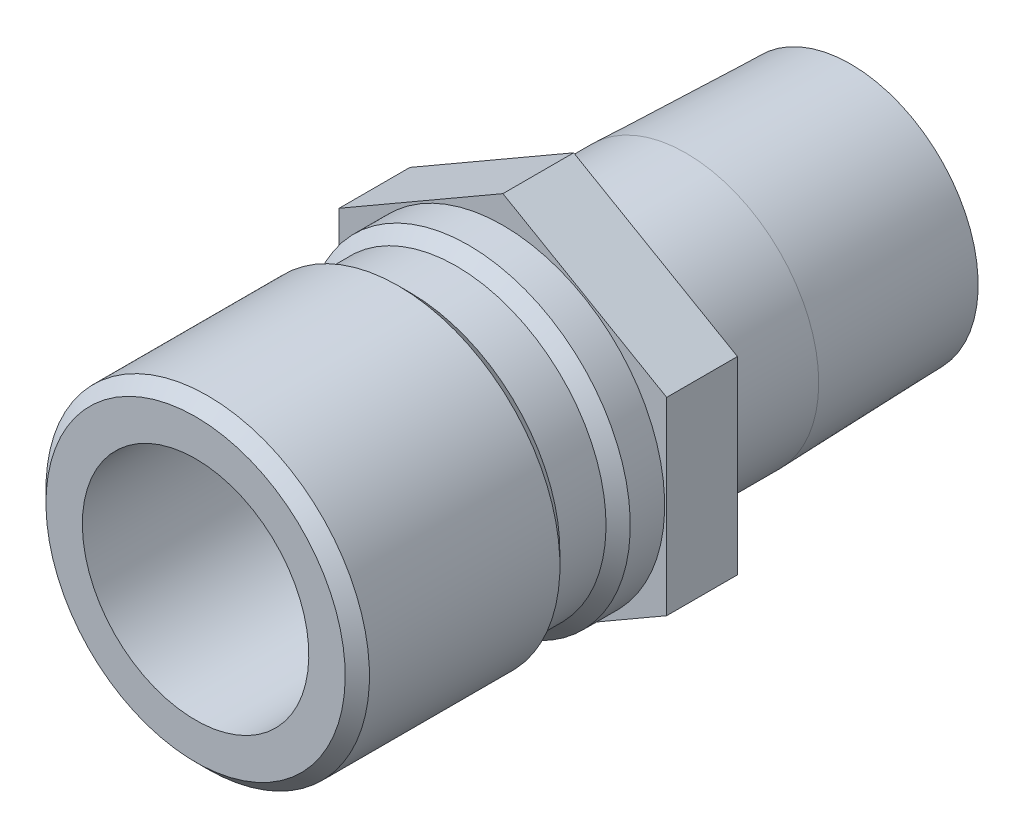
ISO-10303-21;
HEADER;
FILE_DESCRIPTION(('STEP AP214'),'2;1');
FILE_NAME('part.step','',(''),(''),'','','');
FILE_SCHEMA(('AUTOMOTIVE_DESIGN { 1 0 10303 214 1 1 1 1 }'));
ENDSEC;
DATA;
#1=APPLICATION_CONTEXT('core data for automotive mechanical design processes');
#2=APPLICATION_PROTOCOL_DEFINITION('international standard','automotive_design',2000,#1);
#3=PRODUCT_CONTEXT('',#1,'mechanical');
#4=PRODUCT('Part','Part','',(#3));
#5=PRODUCT_RELATED_PRODUCT_CATEGORY('part','',(#4));
#6=PRODUCT_DEFINITION_FORMATION('','',#4);
#7=PRODUCT_DEFINITION_CONTEXT('part definition',#1,'design');
#8=PRODUCT_DEFINITION('design','',#6,#7);
#9=PRODUCT_DEFINITION_SHAPE('','',#8);
#10=(LENGTH_UNIT() NAMED_UNIT(*) SI_UNIT(.MILLI.,.METRE.));
#11=(NAMED_UNIT(*) PLANE_ANGLE_UNIT() SI_UNIT($,.RADIAN.));
#12=(NAMED_UNIT(*) SI_UNIT($,.STERADIAN.) SOLID_ANGLE_UNIT());
#13=UNCERTAINTY_MEASURE_WITH_UNIT(LENGTH_MEASURE(1.E-05),#10,'distance_accuracy_value','');
#14=(GEOMETRIC_REPRESENTATION_CONTEXT(3) GLOBAL_UNCERTAINTY_ASSIGNED_CONTEXT((#13)) GLOBAL_UNIT_ASSIGNED_CONTEXT((#10,
#11,#12)) REPRESENTATION_CONTEXT('',''));
#15=CARTESIAN_POINT('',(0.,0.,0.));
#16=DIRECTION('',(0.,0.,1.));
#17=DIRECTION('',(1.,0.,0.));
#18=AXIS2_PLACEMENT_3D('',#15,#16,#17);
#19=CARTESIAN_POINT('',(0.,0.,0.));
#20=DIRECTION('',(0.,0.,-1.));
#21=DIRECTION('',(0.,1.,0.));
#22=AXIS2_PLACEMENT_3D('',#19,#20,#21);
#23=CYLINDRICAL_SURFACE('',#22,8.3312);
#24=CARTESIAN_POINT('',(0.,0.,-11.5062));
#25=DIRECTION('',(0.,0.,-1.));
#26=DIRECTION('',(0.,1.,0.));
#27=AXIS2_PLACEMENT_3D('',#24,#25,#26);
#28=CIRCLE('',#27,8.3312);
#29=CARTESIAN_POINT('',(0.,8.3312,-11.5062));
#30=VERTEX_POINT('',#29);
#31=EDGE_CURVE('E48',#30,#30,#28,.T.);
#32=ORIENTED_EDGE('',*,*,#31,.F.);
#33=EDGE_LOOP('',(#32));
#34=FACE_BOUND('',#33,.T.);
#35=CARTESIAN_POINT('',(0.,0.,-4.445));
#36=DIRECTION('',(0.,0.,1.));
#37=DIRECTION('',(1.,0.,0.));
#38=AXIS2_PLACEMENT_3D('',#35,#36,#37);
#39=CIRCLE('',#38,8.3312);
#40=CARTESIAN_POINT('',(8.3312,0.,-4.445));
#41=VERTEX_POINT('',#40);
#42=EDGE_CURVE('E144',#41,#41,#39,.F.);
#43=ORIENTED_EDGE('',*,*,#42,.T.);
#44=EDGE_LOOP('',(#43));
#45=FACE_BOUND('',#44,.T.);
#46=ADVANCED_FACE('F39',(#34,#45),#23,.T.);
#47=CARTESIAN_POINT('',(0.,8.00814566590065,-21.844));
#48=DIRECTION('',(0.,0.,-1.));
#49=DIRECTION('',(0.,1.,0.));
#50=AXIS2_PLACEMENT_3D('',#47,#48,#49);
#51=PLANE('',#50);
#52=CARTESIAN_POINT('',(0.,0.,-21.844));
#53=DIRECTION('',(0.,0.,-1.));
#54=DIRECTION('',(0.,1.,0.));
#55=AXIS2_PLACEMENT_3D('',#52,#53,#54);
#56=CIRCLE('',#55,8.00814566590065);
#57=CARTESIAN_POINT('',(0.,8.00814566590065,-21.844));
#58=VERTEX_POINT('',#57);
#59=EDGE_CURVE('E12',#58,#58,#56,.T.);
#60=ORIENTED_EDGE('',*,*,#59,.T.);
#61=EDGE_LOOP('',(#60));
#62=FACE_BOUND('',#61,.T.);
#63=CARTESIAN_POINT('',(0.,0.,-21.844));
#64=DIRECTION('',(0.,0.,-1.));
#65=DIRECTION('',(0.,1.,0.));
#66=AXIS2_PLACEMENT_3D('',#63,#64,#65);
#67=CIRCLE('',#66,6.2611);
#68=CARTESIAN_POINT('',(0.,6.2611,-21.844));
#69=VERTEX_POINT('',#68);
#70=EDGE_CURVE('E152',#69,#69,#67,.T.);
#71=ORIENTED_EDGE('',*,*,#70,.F.);
#72=EDGE_LOOP('',(#71));
#73=FACE_BOUND('',#72,.T.);
#74=ADVANCED_FACE('F41',(#62,#73),#51,.T.);
#75=CARTESIAN_POINT('',(0.,0.,-21.844));
#76=DIRECTION('',(0.,0.,1.));
#77=DIRECTION('',(0.,-1.,0.));
#78=AXIS2_PLACEMENT_3D('',#75,#76,#77);
#79=CONICAL_SURFACE('',#78,8.00814566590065,0.0312396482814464);
#80=ORIENTED_EDGE('',*,*,#31,.T.);
#81=EDGE_LOOP('',(#80));
#82=FACE_BOUND('',#81,.T.);
#83=ORIENTED_EDGE('',*,*,#59,.F.);
#84=EDGE_LOOP('',(#83));
#85=FACE_BOUND('',#84,.T.);
#86=ADVANCED_FACE('F187',(#82,#85),#79,.T.);
#87=CARTESIAN_POINT('',(0.,0.,0.));
#88=DIRECTION('',(0.,0.,-1.));
#89=DIRECTION('',(0.,1.,0.));
#90=AXIS2_PLACEMENT_3D('',#87,#88,#89);
#91=CYLINDRICAL_SURFACE('',#90,10.16);
#92=CARTESIAN_POINT('',(0.,0.,2.159));
#93=DIRECTION('',(0.,0.,-1.));
#94=DIRECTION('',(0.,1.,0.));
#95=AXIS2_PLACEMENT_3D('',#92,#93,#94);
#96=CIRCLE('',#95,10.16);
#97=CARTESIAN_POINT('',(0.,10.16,2.159));
#98=VERTEX_POINT('',#97);
#99=EDGE_CURVE('E179',#98,#98,#96,.T.);
#100=ORIENTED_EDGE('',*,*,#99,.T.);
#101=EDGE_LOOP('',(#100));
#102=FACE_BOUND('',#101,.T.);
#103=CARTESIAN_POINT('',(0.,0.,0.));
#104=DIRECTION('',(0.,0.,-1.));
#105=DIRECTION('',(0.,1.,0.));
#106=AXIS2_PLACEMENT_3D('',#103,#104,#105);
#107=CIRCLE('',#106,10.16);
#108=CARTESIAN_POINT('',(0.,10.16,0.));
#109=VERTEX_POINT('',#108);
#110=EDGE_CURVE('E182',#109,#109,#107,.T.);
#111=ORIENTED_EDGE('',*,*,#110,.F.);
#112=EDGE_LOOP('',(#111));
#113=FACE_BOUND('',#112,.T.);
#114=ADVANCED_FACE('F256',(#102,#113),#91,.T.);
#115=CARTESIAN_POINT('',(0.,0.,2.159));
#116=DIRECTION('',(0.,0.,-1.));
#117=DIRECTION('',(0.,1.,0.));
#118=AXIS2_PLACEMENT_3D('',#115,#116,#117);
#119=CONICAL_SURFACE('',#118,10.16,0.785398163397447);
#120=CARTESIAN_POINT('',(0.,0.,2.921));
#121=DIRECTION('',(0.,0.,-1.));
#122=DIRECTION('',(0.,1.,0.));
#123=AXIS2_PLACEMENT_3D('',#120,#121,#122);
#124=CIRCLE('',#123,9.398);
#125=CARTESIAN_POINT('',(0.,9.398,2.921));
#126=VERTEX_POINT('',#125);
#127=EDGE_CURVE('E176',#126,#126,#124,.T.);
#128=ORIENTED_EDGE('',*,*,#127,.T.);
#129=EDGE_LOOP('',(#128));
#130=FACE_BOUND('',#129,.T.);
#131=ORIENTED_EDGE('',*,*,#99,.F.);
#132=EDGE_LOOP('',(#131));
#133=FACE_BOUND('',#132,.T.);
#134=ADVANCED_FACE('F252',(#130,#133),#119,.T.);
#135=CARTESIAN_POINT('',(0.,0.,0.));
#136=DIRECTION('',(0.,0.,-1.));
#137=DIRECTION('',(0.,1.,0.));
#138=AXIS2_PLACEMENT_3D('',#135,#136,#137);
#139=CYLINDRICAL_SURFACE('',#138,9.398);
#140=CARTESIAN_POINT('',(0.,0.,5.8166));
#141=DIRECTION('',(0.,0.,-1.));
#142=DIRECTION('',(0.,1.,0.));
#143=AXIS2_PLACEMENT_3D('',#140,#141,#142);
#144=CIRCLE('',#143,9.398);
#145=CARTESIAN_POINT('',(0.,9.398,5.8166));
#146=VERTEX_POINT('',#145);
#147=EDGE_CURVE('E173',#146,#146,#144,.T.);
#148=ORIENTED_EDGE('',*,*,#147,.T.);
#149=EDGE_LOOP('',(#148));
#150=FACE_BOUND('',#149,.T.);
#151=ORIENTED_EDGE('',*,*,#127,.F.);
#152=EDGE_LOOP('',(#151));
#153=FACE_BOUND('',#152,.T.);
#154=ADVANCED_FACE('F248',(#150,#153),#139,.T.);
#155=CARTESIAN_POINT('',(0.,0.,5.8166));
#156=DIRECTION('',(0.,0.,1.));
#157=DIRECTION('',(0.,-1.,0.));
#158=AXIS2_PLACEMENT_3D('',#155,#156,#157);
#159=CONICAL_SURFACE('',#158,9.398,0.785398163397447);
#160=CARTESIAN_POINT('',(0.,0.,6.5786));
#161=DIRECTION('',(0.,0.,-1.));
#162=DIRECTION('',(0.,1.,0.));
#163=AXIS2_PLACEMENT_3D('',#160,#161,#162);
#164=CIRCLE('',#163,10.16);
#165=CARTESIAN_POINT('',(0.,10.16,6.5786));
#166=VERTEX_POINT('',#165);
#167=EDGE_CURVE('E170',#166,#166,#164,.T.);
#168=ORIENTED_EDGE('',*,*,#167,.T.);
#169=EDGE_LOOP('',(#168));
#170=FACE_BOUND('',#169,.T.);
#171=ORIENTED_EDGE('',*,*,#147,.F.);
#172=EDGE_LOOP('',(#171));
#173=FACE_BOUND('',#172,.T.);
#174=ADVANCED_FACE('F244',(#170,#173),#159,.T.);
#175=CARTESIAN_POINT('',(0.,0.,0.));
#176=DIRECTION('',(0.,0.,-1.));
#177=DIRECTION('',(0.,1.,0.));
#178=AXIS2_PLACEMENT_3D('',#175,#176,#177);
#179=CYLINDRICAL_SURFACE('',#178,10.16);
#180=CARTESIAN_POINT('',(0.,0.,18.542));
#181=DIRECTION('',(0.,0.,-1.));
#182=DIRECTION('',(0.,1.,0.));
#183=AXIS2_PLACEMENT_3D('',#180,#181,#182);
#184=CIRCLE('',#183,10.16);
#185=CARTESIAN_POINT('',(0.,10.16,18.542));
#186=VERTEX_POINT('',#185);
#187=EDGE_CURVE('E167',#186,#186,#184,.T.);
#188=ORIENTED_EDGE('',*,*,#187,.T.);
#189=EDGE_LOOP('',(#188));
#190=FACE_BOUND('',#189,.T.);
#191=ORIENTED_EDGE('',*,*,#167,.F.);
#192=EDGE_LOOP('',(#191));
#193=FACE_BOUND('',#192,.T.);
#194=ADVANCED_FACE('F240',(#190,#193),#179,.T.);
#195=CARTESIAN_POINT('',(0.,0.,18.542));
#196=DIRECTION('',(0.,0.,-1.));
#197=DIRECTION('',(0.,1.,0.));
#198=AXIS2_PLACEMENT_3D('',#195,#196,#197);
#199=CONICAL_SURFACE('',#198,10.16,0.785398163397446);
#200=CARTESIAN_POINT('',(0.,0.,19.304));
#201=DIRECTION('',(0.,0.,-1.));
#202=DIRECTION('',(0.,1.,0.));
#203=AXIS2_PLACEMENT_3D('',#200,#201,#202);
#204=CIRCLE('',#203,9.398);
#205=CARTESIAN_POINT('',(0.,9.398,19.304));
#206=VERTEX_POINT('',#205);
#207=EDGE_CURVE('E164',#206,#206,#204,.T.);
#208=ORIENTED_EDGE('',*,*,#207,.T.);
#209=EDGE_LOOP('',(#208));
#210=FACE_BOUND('',#209,.T.);
#211=ORIENTED_EDGE('',*,*,#187,.F.);
#212=EDGE_LOOP('',(#211));
#213=FACE_BOUND('',#212,.T.);
#214=ADVANCED_FACE('F236',(#210,#213),#199,.T.);
#215=CARTESIAN_POINT('',(0.,7.112,19.304));
#216=DIRECTION('',(0.,0.,1.));
#217=DIRECTION('',(0.,-1.,0.));
#218=AXIS2_PLACEMENT_3D('',#215,#216,#217);
#219=PLANE('',#218);
#220=CARTESIAN_POINT('',(0.,0.,19.304));
#221=DIRECTION('',(0.,0.,-1.));
#222=DIRECTION('',(0.,1.,0.));
#223=AXIS2_PLACEMENT_3D('',#220,#221,#222);
#224=CIRCLE('',#223,7.112);
#225=CARTESIAN_POINT('',(0.,7.112,19.304));
#226=VERTEX_POINT('',#225);
#227=EDGE_CURVE('E161',#226,#226,#224,.T.);
#228=ORIENTED_EDGE('',*,*,#227,.T.);
#229=EDGE_LOOP('',(#228));
#230=FACE_BOUND('',#229,.T.);
#231=ORIENTED_EDGE('',*,*,#207,.F.);
#232=EDGE_LOOP('',(#231));
#233=FACE_BOUND('',#232,.T.);
#234=ADVANCED_FACE('F232',(#230,#233),#219,.T.);
#235=CARTESIAN_POINT('',(0.,0.,0.));
#236=DIRECTION('',(0.,0.,-1.));
#237=DIRECTION('',(0.,1.,0.));
#238=AXIS2_PLACEMENT_3D('',#235,#236,#237);
#239=CYLINDRICAL_SURFACE('',#238,7.112);
#240=CARTESIAN_POINT('',(0.,0.,1.524));
#241=DIRECTION('',(0.,0.,-1.));
#242=DIRECTION('',(0.,1.,0.));
#243=AXIS2_PLACEMENT_3D('',#240,#241,#242);
#244=CIRCLE('',#243,7.112);
#245=CARTESIAN_POINT('',(0.,7.112,1.524));
#246=VERTEX_POINT('',#245);
#247=EDGE_CURVE('E158',#246,#246,#244,.T.);
#248=ORIENTED_EDGE('',*,*,#247,.T.);
#249=EDGE_LOOP('',(#248));
#250=FACE_BOUND('',#249,.T.);
#251=ORIENTED_EDGE('',*,*,#227,.F.);
#252=EDGE_LOOP('',(#251));
#253=FACE_BOUND('',#252,.T.);
#254=ADVANCED_FACE('F228',(#250,#253),#239,.F.);
#255=CARTESIAN_POINT('',(0.,0.,1.524));
#256=DIRECTION('',(0.,0.,1.));
#257=DIRECTION('',(0.,-1.,0.));
#258=AXIS2_PLACEMENT_3D('',#255,#256,#257);
#259=CONICAL_SURFACE('',#258,7.112,1.08210413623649);
#260=CARTESIAN_POINT('',(0.,0.,1.07156844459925));
#261=DIRECTION('',(0.,0.,-1.));
#262=DIRECTION('',(0.,1.,0.));
#263=AXIS2_PLACEMENT_3D('',#260,#261,#262);
#264=CIRCLE('',#263,6.2611);
#265=CARTESIAN_POINT('',(0.,6.2611,1.07156844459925));
#266=VERTEX_POINT('',#265);
#267=EDGE_CURVE('E155',#266,#266,#264,.T.);
#268=ORIENTED_EDGE('',*,*,#267,.T.);
#269=EDGE_LOOP('',(#268));
#270=FACE_BOUND('',#269,.T.);
#271=ORIENTED_EDGE('',*,*,#247,.F.);
#272=EDGE_LOOP('',(#271));
#273=FACE_BOUND('',#272,.T.);
#274=ADVANCED_FACE('F224',(#270,#273),#259,.F.);
#275=CARTESIAN_POINT('',(0.,0.,0.));
#276=DIRECTION('',(0.,0.,-1.));
#277=DIRECTION('',(0.,1.,0.));
#278=AXIS2_PLACEMENT_3D('',#275,#276,#277);
#279=CYLINDRICAL_SURFACE('',#278,6.2611);
#280=ORIENTED_EDGE('',*,*,#267,.F.);
#281=EDGE_LOOP('',(#280));
#282=FACE_BOUND('',#281,.T.);
#283=ORIENTED_EDGE('',*,*,#70,.T.);
#284=EDGE_LOOP('',(#283));
#285=FACE_BOUND('',#284,.T.);
#286=ADVANCED_FACE('F221',(#282,#285),#279,.F.);
#287=CARTESIAN_POINT('',(0.,11.8784044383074,-4.445));
#288=DIRECTION('',(-0.5,0.866025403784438,0.));
#289=DIRECTION('',(-0.866025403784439,-0.5,0.));
#290=AXIS2_PLACEMENT_3D('',#287,#288,#289);
#291=PLANE('',#290);
#292=DIRECTION('',(-0.866025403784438,-0.5,0.));
#293=VECTOR('',#292,1.);
#294=CARTESIAN_POINT('',(0.,11.8784044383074,0.));
#295=LINE('',#294,#293);
#296=CARTESIAN_POINT('',(0.,11.8784044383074,0.));
#297=VERTEX_POINT('',#296);
#298=CARTESIAN_POINT('',(-10.287,5.93920221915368,0.));
#299=VERTEX_POINT('',#298);
#300=EDGE_CURVE('E127',#297,#299,#295,.T.);
#301=ORIENTED_EDGE('',*,*,#300,.F.);
#302=DIRECTION('',(0.,0.,1.));
#303=VECTOR('',#302,1.);
#304=CARTESIAN_POINT('',(0.,11.8784044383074,-4.445));
#305=LINE('',#304,#303);
#306=CARTESIAN_POINT('',(0.,11.8784044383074,-4.445));
#307=VERTEX_POINT('',#306);
#308=EDGE_CURVE('E56',#307,#297,#305,.T.);
#309=ORIENTED_EDGE('',*,*,#308,.F.);
#310=DIRECTION('',(-0.866025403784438,-0.5,0.));
#311=VECTOR('',#310,1.);
#312=CARTESIAN_POINT('',(0.,11.8784044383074,-4.445));
#313=LINE('',#312,#311);
#314=CARTESIAN_POINT('',(-10.287,5.93920221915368,-4.445));
#315=VERTEX_POINT('',#314);
#316=EDGE_CURVE('E142',#307,#315,#313,.T.);
#317=ORIENTED_EDGE('',*,*,#316,.T.);
#318=DIRECTION('',(0.,0.,1.));
#319=VECTOR('',#318,1.);
#320=CARTESIAN_POINT('',(-10.287,5.93920221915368,-4.445));
#321=LINE('',#320,#319);
#322=EDGE_CURVE('E91',#315,#299,#321,.T.);
#323=ORIENTED_EDGE('',*,*,#322,.T.);
#324=EDGE_LOOP('',(#301,#309,#317,#323));
#325=FACE_BOUND('',#324,.T.);
#326=ADVANCED_FACE('F211',(#325),#291,.T.);
#327=CARTESIAN_POINT('',(10.287,5.93920221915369,-4.445));
#328=DIRECTION('',(0.5,0.866025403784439,0.));
#329=DIRECTION('',(-0.866025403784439,0.5,0.));
#330=AXIS2_PLACEMENT_3D('',#327,#328,#329);
#331=PLANE('',#330);
#332=DIRECTION('',(-0.866025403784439,0.5,0.));
#333=VECTOR('',#332,1.);
#334=CARTESIAN_POINT('',(10.287,5.93920221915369,0.));
#335=LINE('',#334,#333);
#336=CARTESIAN_POINT('',(10.287,5.93920221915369,0.));
#337=VERTEX_POINT('',#336);
#338=EDGE_CURVE('E139',#337,#297,#335,.T.);
#339=ORIENTED_EDGE('',*,*,#338,.F.);
#340=DIRECTION('',(0.,0.,1.));
#341=VECTOR('',#340,1.);
#342=CARTESIAN_POINT('',(10.287,5.93920221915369,-4.445));
#343=LINE('',#342,#341);
#344=CARTESIAN_POINT('',(10.287,5.93920221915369,-4.445));
#345=VERTEX_POINT('',#344);
#346=EDGE_CURVE('E79',#345,#337,#343,.T.);
#347=ORIENTED_EDGE('',*,*,#346,.F.);
#348=DIRECTION('',(-0.866025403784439,0.5,0.));
#349=VECTOR('',#348,1.);
#350=CARTESIAN_POINT('',(10.287,5.93920221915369,-4.445));
#351=LINE('',#350,#349);
#352=EDGE_CURVE('E117',#345,#307,#351,.T.);
#353=ORIENTED_EDGE('',*,*,#352,.T.);
#354=ORIENTED_EDGE('',*,*,#308,.T.);
#355=EDGE_LOOP('',(#339,#347,#353,#354));
#356=FACE_BOUND('',#355,.T.);
#357=ADVANCED_FACE('F208',(#356),#331,.T.);
#358=CARTESIAN_POINT('',(10.287,-5.93920221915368,-4.445));
#359=DIRECTION('',(1.,0.,0.));
#360=DIRECTION('',(0.,0.,-1.));
#361=AXIS2_PLACEMENT_3D('',#358,#359,#360);
#362=PLANE('',#361);
#363=DIRECTION('',(0.,1.,0.));
#364=VECTOR('',#363,1.);
#365=CARTESIAN_POINT('',(10.287,-5.93920221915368,0.));
#366=LINE('',#365,#364);
#367=CARTESIAN_POINT('',(10.287,-5.93920221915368,0.));
#368=VERTEX_POINT('',#367);
#369=EDGE_CURVE('E104',#368,#337,#366,.T.);
#370=ORIENTED_EDGE('',*,*,#369,.F.);
#371=DIRECTION('',(0.,0.,1.));
#372=VECTOR('',#371,1.);
#373=CARTESIAN_POINT('',(10.287,-5.93920221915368,-4.445));
#374=LINE('',#373,#372);
#375=CARTESIAN_POINT('',(10.287,-5.93920221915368,-4.445));
#376=VERTEX_POINT('',#375);
#377=EDGE_CURVE('E99',#376,#368,#374,.T.);
#378=ORIENTED_EDGE('',*,*,#377,.F.);
#379=DIRECTION('',(0.,1.,0.));
#380=VECTOR('',#379,1.);
#381=CARTESIAN_POINT('',(10.287,-5.93920221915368,-4.445));
#382=LINE('',#381,#380);
#383=EDGE_CURVE('E102',#376,#345,#382,.T.);
#384=ORIENTED_EDGE('',*,*,#383,.T.);
#385=ORIENTED_EDGE('',*,*,#346,.T.);
#386=EDGE_LOOP('',(#370,#378,#384,#385));
#387=FACE_BOUND('',#386,.T.);
#388=ADVANCED_FACE('F101',(#387),#362,.T.);
#389=CARTESIAN_POINT('',(0.,-11.8784044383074,-4.445));
#390=DIRECTION('',(0.5,-0.866025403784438,0.));
#391=DIRECTION('',(0.866025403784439,0.5,0.));
#392=AXIS2_PLACEMENT_3D('',#389,#390,#391);
#393=PLANE('',#392);
#394=DIRECTION('',(0.866025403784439,0.5,0.));
#395=VECTOR('',#394,1.);
#396=CARTESIAN_POINT('',(0.,-11.8784044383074,0.));
#397=LINE('',#396,#395);
#398=CARTESIAN_POINT('',(0.,-11.8784044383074,0.));
#399=VERTEX_POINT('',#398);
#400=EDGE_CURVE('E136',#399,#368,#397,.T.);
#401=ORIENTED_EDGE('',*,*,#400,.F.);
#402=DIRECTION('',(0.,0.,1.));
#403=VECTOR('',#402,1.);
#404=CARTESIAN_POINT('',(0.,-11.8784044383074,-4.445));
#405=LINE('',#404,#403);
#406=CARTESIAN_POINT('',(0.,-11.8784044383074,-4.445));
#407=VERTEX_POINT('',#406);
#408=EDGE_CURVE('E109',#407,#399,#405,.T.);
#409=ORIENTED_EDGE('',*,*,#408,.F.);
#410=DIRECTION('',(0.866025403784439,0.5,0.));
#411=VECTOR('',#410,1.);
#412=CARTESIAN_POINT('',(0.,-11.8784044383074,-4.445));
#413=LINE('',#412,#411);
#414=EDGE_CURVE('E115',#407,#376,#413,.T.);
#415=ORIENTED_EDGE('',*,*,#414,.T.);
#416=ORIENTED_EDGE('',*,*,#377,.T.);
#417=EDGE_LOOP('',(#401,#409,#415,#416));
#418=FACE_BOUND('',#417,.T.);
#419=ADVANCED_FACE('F119',(#418),#393,.T.);
#420=CARTESIAN_POINT('',(-10.287,-5.93920221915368,-4.445));
#421=DIRECTION('',(-0.5,-0.866025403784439,0.));
#422=DIRECTION('',(0.866025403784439,-0.5,0.));
#423=AXIS2_PLACEMENT_3D('',#420,#421,#422);
#424=PLANE('',#423);
#425=DIRECTION('',(0.866025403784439,-0.5,0.));
#426=VECTOR('',#425,1.);
#427=CARTESIAN_POINT('',(-10.287,-5.93920221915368,0.));
#428=LINE('',#427,#426);
#429=CARTESIAN_POINT('',(-10.287,-5.93920221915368,0.));
#430=VERTEX_POINT('',#429);
#431=EDGE_CURVE('E133',#430,#399,#428,.T.);
#432=ORIENTED_EDGE('',*,*,#431,.F.);
#433=DIRECTION('',(0.,0.,1.));
#434=VECTOR('',#433,1.);
#435=CARTESIAN_POINT('',(-10.287,-5.93920221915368,-4.445));
#436=LINE('',#435,#434);
#437=CARTESIAN_POINT('',(-10.287,-5.93920221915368,-4.445));
#438=VERTEX_POINT('',#437);
#439=EDGE_CURVE('E147',#438,#430,#436,.T.);
#440=ORIENTED_EDGE('',*,*,#439,.F.);
#441=DIRECTION('',(0.866025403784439,-0.5,0.));
#442=VECTOR('',#441,1.);
#443=CARTESIAN_POINT('',(-10.287,-5.93920221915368,-4.445));
#444=LINE('',#443,#442);
#445=EDGE_CURVE('E120',#438,#407,#444,.T.);
#446=ORIENTED_EDGE('',*,*,#445,.T.);
#447=ORIENTED_EDGE('',*,*,#408,.T.);
#448=EDGE_LOOP('',(#432,#440,#446,#447));
#449=FACE_BOUND('',#448,.T.);
#450=ADVANCED_FACE('F205',(#449),#424,.T.);
#451=CARTESIAN_POINT('',(-10.287,5.93920221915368,-4.445));
#452=DIRECTION('',(-1.,0.,0.));
#453=DIRECTION('',(0.,0.,1.));
#454=AXIS2_PLACEMENT_3D('',#451,#452,#453);
#455=PLANE('',#454);
#456=DIRECTION('',(0.,-1.,0.));
#457=VECTOR('',#456,1.);
#458=CARTESIAN_POINT('',(-10.287,5.93920221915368,0.));
#459=LINE('',#458,#457);
#460=EDGE_CURVE('E130',#299,#430,#459,.T.);
#461=ORIENTED_EDGE('',*,*,#460,.F.);
#462=ORIENTED_EDGE('',*,*,#322,.F.);
#463=DIRECTION('',(0.,-1.,0.));
#464=VECTOR('',#463,1.);
#465=CARTESIAN_POINT('',(-10.287,5.93920221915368,-4.445));
#466=LINE('',#465,#464);
#467=EDGE_CURVE('E122',#315,#438,#466,.T.);
#468=ORIENTED_EDGE('',*,*,#467,.T.);
#469=ORIENTED_EDGE('',*,*,#439,.T.);
#470=EDGE_LOOP('',(#461,#462,#468,#469));
#471=FACE_BOUND('',#470,.T.);
#472=ADVANCED_FACE('F197',(#471),#455,.T.);
#473=CARTESIAN_POINT('',(-10.287,5.93920221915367,-4.445));
#474=DIRECTION('',(0.,0.,1.));
#475=DIRECTION('',(1.,0.,0.));
#476=AXIS2_PLACEMENT_3D('',#473,#474,#475);
#477=PLANE('',#476);
#478=ORIENTED_EDGE('',*,*,#42,.F.);
#479=EDGE_LOOP('',(#478));
#480=FACE_BOUND('',#479,.T.);
#481=ORIENTED_EDGE('',*,*,#316,.F.);
#482=ORIENTED_EDGE('',*,*,#352,.F.);
#483=ORIENTED_EDGE('',*,*,#383,.F.);
#484=ORIENTED_EDGE('',*,*,#414,.F.);
#485=ORIENTED_EDGE('',*,*,#445,.F.);
#486=ORIENTED_EDGE('',*,*,#467,.F.);
#487=EDGE_LOOP('',(#481,#482,#483,#484,#485,#486));
#488=FACE_BOUND('',#487,.T.);
#489=ADVANCED_FACE('F113',(#480,#488),#477,.F.);
#490=CARTESIAN_POINT('',(-10.287,5.93920221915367,0.));
#491=DIRECTION('',(0.,0.,1.));
#492=DIRECTION('',(1.,0.,0.));
#493=AXIS2_PLACEMENT_3D('',#490,#491,#492);
#494=PLANE('',#493);
#495=ORIENTED_EDGE('',*,*,#110,.T.);
#496=EDGE_LOOP('',(#495));
#497=FACE_BOUND('',#496,.T.);
#498=ORIENTED_EDGE('',*,*,#300,.T.);
#499=ORIENTED_EDGE('',*,*,#460,.T.);
#500=ORIENTED_EDGE('',*,*,#431,.T.);
#501=ORIENTED_EDGE('',*,*,#400,.T.);
#502=ORIENTED_EDGE('',*,*,#369,.T.);
#503=ORIENTED_EDGE('',*,*,#338,.T.);
#504=EDGE_LOOP('',(#498,#499,#500,#501,#502,#503));
#505=FACE_BOUND('',#504,.T.);
#506=ADVANCED_FACE('F196',(#497,#505),#494,.T.);
#507=CLOSED_SHELL('',(#46,#74,#86,#114,#134,#154,#174,#194,#214,#234,#254,#274,#286,#326,#357,
#388,#419,#450,#472,#489,#506));
#508=MANIFOLD_SOLID_BREP('B2',#507);
#509=ADVANCED_BREP_SHAPE_REPRESENTATION('',(#18,#508),#14);
#510=SHAPE_DEFINITION_REPRESENTATION(#9,#509);
ENDSEC;
END-ISO-10303-21;
